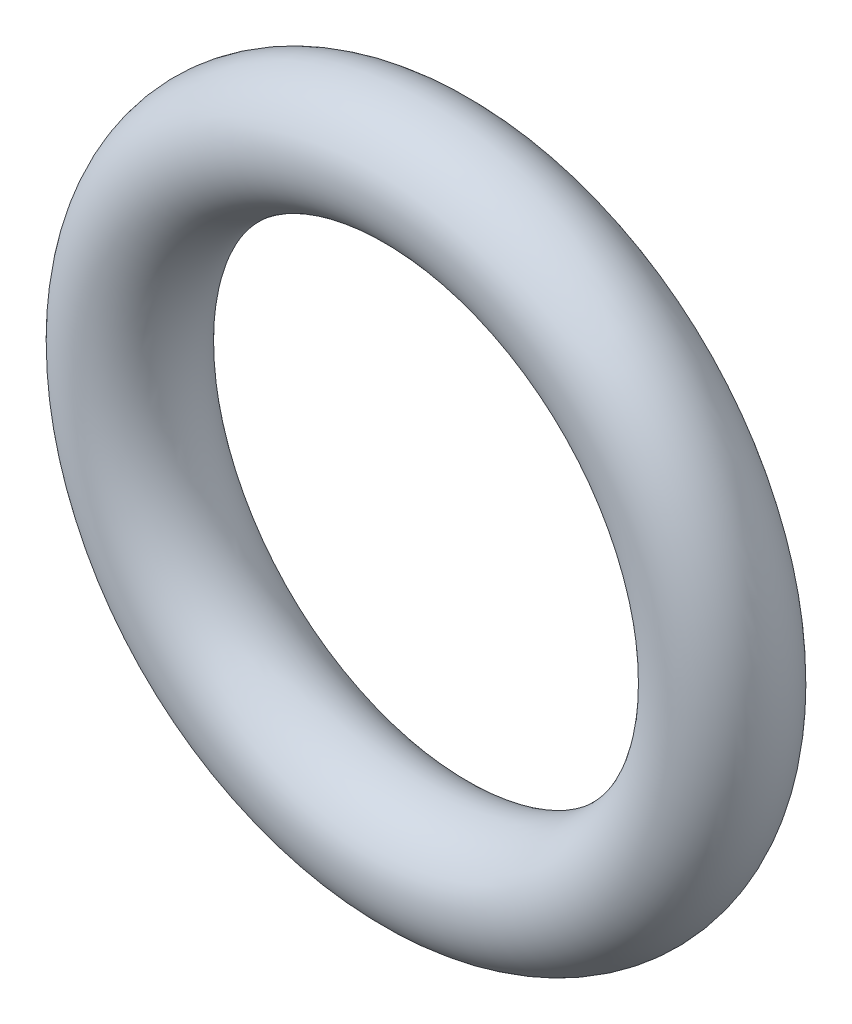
ISO-10303-21;
HEADER;
FILE_DESCRIPTION(('STEP AP214'),'2;1');
FILE_NAME('part.step','',(''),(''),'','','');
FILE_SCHEMA(('AUTOMOTIVE_DESIGN { 1 0 10303 214 1 1 1 1 }'));
ENDSEC;
DATA;
#1=APPLICATION_CONTEXT('core data for automotive mechanical design processes');
#2=APPLICATION_PROTOCOL_DEFINITION('international standard','automotive_design',2000,#1);
#3=PRODUCT_CONTEXT('',#1,'mechanical');
#4=PRODUCT('Part','Part','',(#3));
#5=PRODUCT_RELATED_PRODUCT_CATEGORY('part','',(#4));
#6=PRODUCT_DEFINITION_FORMATION('','',#4);
#7=PRODUCT_DEFINITION_CONTEXT('part definition',#1,'design');
#8=PRODUCT_DEFINITION('design','',#6,#7);
#9=PRODUCT_DEFINITION_SHAPE('','',#8);
#10=(LENGTH_UNIT() NAMED_UNIT(*) SI_UNIT(.MILLI.,.METRE.));
#11=(NAMED_UNIT(*) PLANE_ANGLE_UNIT() SI_UNIT($,.RADIAN.));
#12=(NAMED_UNIT(*) SI_UNIT($,.STERADIAN.) SOLID_ANGLE_UNIT());
#13=UNCERTAINTY_MEASURE_WITH_UNIT(LENGTH_MEASURE(1.E-05),#10,'distance_accuracy_value','');
#14=(GEOMETRIC_REPRESENTATION_CONTEXT(3) GLOBAL_UNCERTAINTY_ASSIGNED_CONTEXT((#13)) GLOBAL_UNIT_ASSIGNED_CONTEXT((#10,
#11,#12)) REPRESENTATION_CONTEXT('',''));
#15=CARTESIAN_POINT('',(0.,0.,0.));
#16=DIRECTION('',(0.,0.,1.));
#17=DIRECTION('',(1.,0.,0.));
#18=AXIS2_PLACEMENT_3D('',#15,#16,#17);
#19=CARTESIAN_POINT('',(0.,0.,1.));
#20=DIRECTION('',(0.,0.,-1.));
#21=DIRECTION('',(-1.,0.,0.));
#22=AXIS2_PLACEMENT_3D('',#19,#20,#21);
#23=TOROIDAL_SURFACE('',#22,5.,1.);
#24=ADVANCED_FACE('F13',(),#23,.T.);
#25=CLOSED_SHELL('',(#24));
#26=MANIFOLD_SOLID_BREP('B1',#25);
#27=ADVANCED_BREP_SHAPE_REPRESENTATION('',(#18,#26),#14);
#28=SHAPE_DEFINITION_REPRESENTATION(#9,#27);
ENDSEC;
END-ISO-10303-21;
